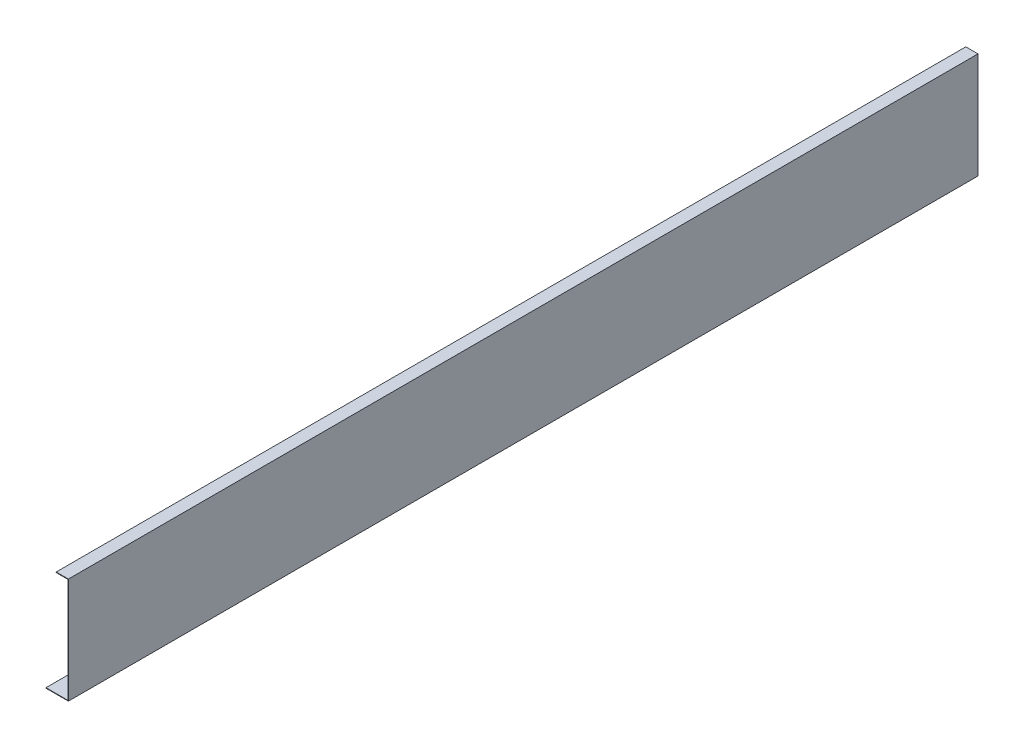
from build123d import *

# Parameters (mm, degrees)
BOSS_EXTRU_2_DEPTH      = 1118
ESQUISSE2_W             = 2.5
ESQUISSE2_H             = 32.5
ENL_V_MAT_EXTRU_1_DEPTH = 1126.932502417


with BuildPart() as part:
    # Esquisse1 → Boss.-Extru.2 (new body)
    with BuildSketch(Plane.XY):
        Polygon((0, 0), (30, 0), (30, 130), (15, 130), (15, 129.35), (29.35, 129.35), (29.35, 0.65), (0.65, 0.65), (0.65, 20), (0, 20), align=None)
    extrude(amount=BOSS_EXTRU_2_DEPTH)

    # Esquisse2 → Enl_v. mat.-Extru.1 (cut, through all)
    with BuildSketch(Plane.XZ):
        with Locations((1.25, 16.25)):
            Rectangle(ESQUISSE2_W, ESQUISSE2_H)
        with Locations((1.25, 1101.75)):
            Rectangle(ESQUISSE2_W, ESQUISSE2_H)
    extrude(amount=-ENL_V_MAT_EXTRU_1_DEPTH, mode=Mode.SUBTRACT)


solid = part.part
